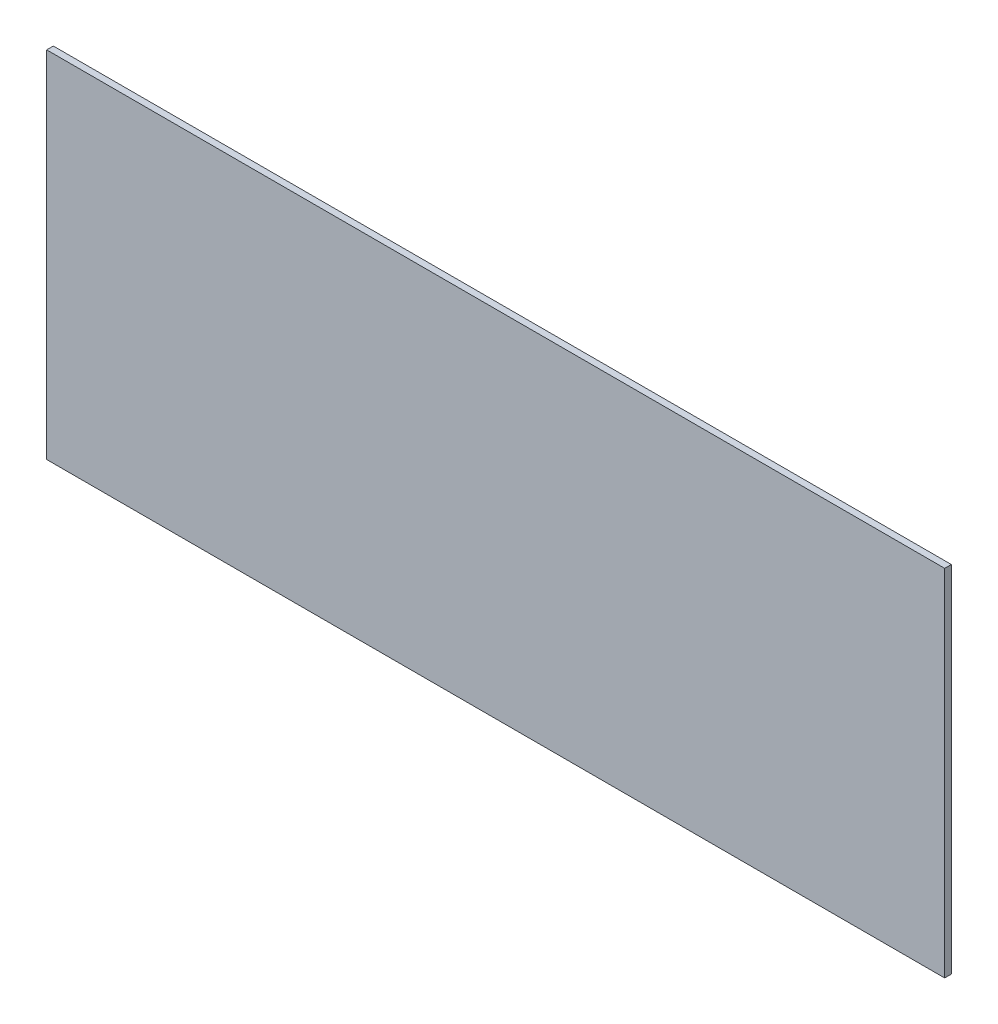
ISO-10303-21;
HEADER;
FILE_DESCRIPTION(('STEP AP214'),'2;1');
FILE_NAME('part.step','',(''),(''),'','','');
FILE_SCHEMA(('AUTOMOTIVE_DESIGN { 1 0 10303 214 1 1 1 1 }'));
ENDSEC;
DATA;
#1=APPLICATION_CONTEXT('core data for automotive mechanical design processes');
#2=APPLICATION_PROTOCOL_DEFINITION('international standard','automotive_design',2000,#1);
#3=PRODUCT_CONTEXT('',#1,'mechanical');
#4=PRODUCT('Part','Part','',(#3));
#5=PRODUCT_RELATED_PRODUCT_CATEGORY('part','',(#4));
#6=PRODUCT_DEFINITION_FORMATION('','',#4);
#7=PRODUCT_DEFINITION_CONTEXT('part definition',#1,'design');
#8=PRODUCT_DEFINITION('design','',#6,#7);
#9=PRODUCT_DEFINITION_SHAPE('','',#8);
#10=(LENGTH_UNIT() NAMED_UNIT(*) SI_UNIT(.MILLI.,.METRE.));
#11=(NAMED_UNIT(*) PLANE_ANGLE_UNIT() SI_UNIT($,.RADIAN.));
#12=(NAMED_UNIT(*) SI_UNIT($,.STERADIAN.) SOLID_ANGLE_UNIT());
#13=UNCERTAINTY_MEASURE_WITH_UNIT(LENGTH_MEASURE(1.E-05),#10,'distance_accuracy_value','');
#14=(GEOMETRIC_REPRESENTATION_CONTEXT(3) GLOBAL_UNCERTAINTY_ASSIGNED_CONTEXT((#13)) GLOBAL_UNIT_ASSIGNED_CONTEXT((#10,
#11,#12)) REPRESENTATION_CONTEXT('',''));
#15=CARTESIAN_POINT('',(0.,0.,0.));
#16=DIRECTION('',(0.,0.,1.));
#17=DIRECTION('',(1.,0.,0.));
#18=AXIS2_PLACEMENT_3D('',#15,#16,#17);
#19=CARTESIAN_POINT('',(202.5,-80.,3.));
#20=DIRECTION('',(-1.,0.,0.));
#21=DIRECTION('',(0.,0.,1.));
#22=AXIS2_PLACEMENT_3D('',#19,#20,#21);
#23=PLANE('',#22);
#24=DIRECTION('',(0.,1.,0.));
#25=VECTOR('',#24,1.);
#26=CARTESIAN_POINT('',(202.5,-80.,0.));
#27=LINE('',#26,#25);
#28=CARTESIAN_POINT('',(202.5,-80.,0.));
#29=VERTEX_POINT('',#28);
#30=CARTESIAN_POINT('',(202.5,80.,0.));
#31=VERTEX_POINT('',#30);
#32=EDGE_CURVE('E113',#29,#31,#27,.T.);
#33=ORIENTED_EDGE('',*,*,#32,.T.);
#34=DIRECTION('',(0.,0.,-1.));
#35=VECTOR('',#34,1.);
#36=CARTESIAN_POINT('',(202.5,80.,3.));
#37=LINE('',#36,#35);
#38=CARTESIAN_POINT('',(202.5,80.,3.));
#39=VERTEX_POINT('',#38);
#40=EDGE_CURVE('E11',#39,#31,#37,.T.);
#41=ORIENTED_EDGE('',*,*,#40,.F.);
#42=DIRECTION('',(0.,1.,0.));
#43=VECTOR('',#42,1.);
#44=CARTESIAN_POINT('',(202.5,-80.,3.));
#45=LINE('',#44,#43);
#46=CARTESIAN_POINT('',(202.5,-80.,3.));
#47=VERTEX_POINT('',#46);
#48=EDGE_CURVE('E97',#47,#39,#45,.T.);
#49=ORIENTED_EDGE('',*,*,#48,.F.);
#50=DIRECTION('',(0.,0.,-1.));
#51=VECTOR('',#50,1.);
#52=CARTESIAN_POINT('',(202.5,-80.,3.));
#53=LINE('',#52,#51);
#54=EDGE_CURVE('E109',#47,#29,#53,.T.);
#55=ORIENTED_EDGE('',*,*,#54,.T.);
#56=EDGE_LOOP('',(#33,#41,#49,#55));
#57=FACE_BOUND('',#56,.T.);
#58=ADVANCED_FACE('F45',(#57),#23,.F.);
#59=CARTESIAN_POINT('',(-202.5,80.,3.));
#60=DIRECTION('',(0.,-1.,0.));
#61=DIRECTION('',(0.,0.,-1.));
#62=AXIS2_PLACEMENT_3D('',#59,#60,#61);
#63=PLANE('',#62);
#64=DIRECTION('',(-1.,0.,0.));
#65=VECTOR('',#64,1.);
#66=CARTESIAN_POINT('',(-202.5,80.,0.));
#67=LINE('',#66,#65);
#68=CARTESIAN_POINT('',(-202.5,80.,0.));
#69=VERTEX_POINT('',#68);
#70=EDGE_CURVE('E102',#31,#69,#67,.T.);
#71=ORIENTED_EDGE('',*,*,#70,.T.);
#72=DIRECTION('',(0.,0.,-1.));
#73=VECTOR('',#72,1.);
#74=CARTESIAN_POINT('',(-202.5,80.,3.));
#75=LINE('',#74,#73);
#76=CARTESIAN_POINT('',(-202.5,80.,3.));
#77=VERTEX_POINT('',#76);
#78=EDGE_CURVE('E54',#77,#69,#75,.T.);
#79=ORIENTED_EDGE('',*,*,#78,.F.);
#80=DIRECTION('',(-1.,0.,0.));
#81=VECTOR('',#80,1.);
#82=CARTESIAN_POINT('',(-202.5,80.,3.));
#83=LINE('',#82,#81);
#84=EDGE_CURVE('E92',#39,#77,#83,.T.);
#85=ORIENTED_EDGE('',*,*,#84,.F.);
#86=ORIENTED_EDGE('',*,*,#40,.T.);
#87=EDGE_LOOP('',(#71,#79,#85,#86));
#88=FACE_BOUND('',#87,.T.);
#89=ADVANCED_FACE('F101',(#88),#63,.F.);
#90=CARTESIAN_POINT('',(-202.5,-80.,3.));
#91=DIRECTION('',(1.,0.,0.));
#92=DIRECTION('',(0.,0.,-1.));
#93=AXIS2_PLACEMENT_3D('',#90,#91,#92);
#94=PLANE('',#93);
#95=DIRECTION('',(0.,-1.,0.));
#96=VECTOR('',#95,1.);
#97=CARTESIAN_POINT('',(-202.5,-80.,0.));
#98=LINE('',#97,#96);
#99=CARTESIAN_POINT('',(-202.5,-80.,0.));
#100=VERTEX_POINT('',#99);
#101=EDGE_CURVE('E79',#69,#100,#98,.T.);
#102=ORIENTED_EDGE('',*,*,#101,.T.);
#103=DIRECTION('',(0.,0.,-1.));
#104=VECTOR('',#103,1.);
#105=CARTESIAN_POINT('',(-202.5,-80.,3.));
#106=LINE('',#105,#104);
#107=CARTESIAN_POINT('',(-202.5,-80.,3.));
#108=VERTEX_POINT('',#107);
#109=EDGE_CURVE('E104',#108,#100,#106,.T.);
#110=ORIENTED_EDGE('',*,*,#109,.F.);
#111=DIRECTION('',(0.,-1.,0.));
#112=VECTOR('',#111,1.);
#113=CARTESIAN_POINT('',(-202.5,-80.,3.));
#114=LINE('',#113,#112);
#115=EDGE_CURVE('E95',#77,#108,#114,.T.);
#116=ORIENTED_EDGE('',*,*,#115,.F.);
#117=ORIENTED_EDGE('',*,*,#78,.T.);
#118=EDGE_LOOP('',(#102,#110,#116,#117));
#119=FACE_BOUND('',#118,.T.);
#120=ADVANCED_FACE('F105',(#119),#94,.F.);
#121=CARTESIAN_POINT('',(-202.5,-80.,3.));
#122=DIRECTION('',(0.,1.,0.));
#123=DIRECTION('',(0.,0.,1.));
#124=AXIS2_PLACEMENT_3D('',#121,#122,#123);
#125=PLANE('',#124);
#126=DIRECTION('',(1.,0.,0.));
#127=VECTOR('',#126,1.);
#128=CARTESIAN_POINT('',(-202.5,-80.,0.));
#129=LINE('',#128,#127);
#130=EDGE_CURVE('E85',#100,#29,#129,.T.);
#131=ORIENTED_EDGE('',*,*,#130,.T.);
#132=ORIENTED_EDGE('',*,*,#54,.F.);
#133=DIRECTION('',(1.,0.,0.));
#134=VECTOR('',#133,1.);
#135=CARTESIAN_POINT('',(-202.5,-80.,3.));
#136=LINE('',#135,#134);
#137=EDGE_CURVE('E62',#108,#47,#136,.T.);
#138=ORIENTED_EDGE('',*,*,#137,.F.);
#139=ORIENTED_EDGE('',*,*,#109,.T.);
#140=EDGE_LOOP('',(#131,#132,#138,#139));
#141=FACE_BOUND('',#140,.T.);
#142=ADVANCED_FACE('F126',(#141),#125,.F.);
#143=CARTESIAN_POINT('',(0.,0.,3.));
#144=DIRECTION('',(0.,0.,-1.));
#145=DIRECTION('',(-1.,0.,0.));
#146=AXIS2_PLACEMENT_3D('',#143,#144,#145);
#147=PLANE('',#146);
#148=ORIENTED_EDGE('',*,*,#48,.T.);
#149=ORIENTED_EDGE('',*,*,#84,.T.);
#150=ORIENTED_EDGE('',*,*,#115,.T.);
#151=ORIENTED_EDGE('',*,*,#137,.T.);
#152=EDGE_LOOP('',(#148,#149,#150,#151));
#153=FACE_BOUND('',#152,.T.);
#154=ADVANCED_FACE('F93',(#153),#147,.F.);
#155=CARTESIAN_POINT('',(0.,0.,0.));
#156=DIRECTION('',(0.,0.,-1.));
#157=DIRECTION('',(-1.,0.,0.));
#158=AXIS2_PLACEMENT_3D('',#155,#156,#157);
#159=PLANE('',#158);
#160=ORIENTED_EDGE('',*,*,#32,.F.);
#161=ORIENTED_EDGE('',*,*,#130,.F.);
#162=ORIENTED_EDGE('',*,*,#101,.F.);
#163=ORIENTED_EDGE('',*,*,#70,.F.);
#164=EDGE_LOOP('',(#160,#161,#162,#163));
#165=FACE_BOUND('',#164,.T.);
#166=ADVANCED_FACE('F129',(#165),#159,.T.);
#167=CLOSED_SHELL('',(#58,#89,#120,#142,#154,#166));
#168=MANIFOLD_SOLID_BREP('B2',#167);
#169=ADVANCED_BREP_SHAPE_REPRESENTATION('',(#18,#168),#14);
#170=SHAPE_DEFINITION_REPRESENTATION(#9,#169);
ENDSEC;
END-ISO-10303-21;
